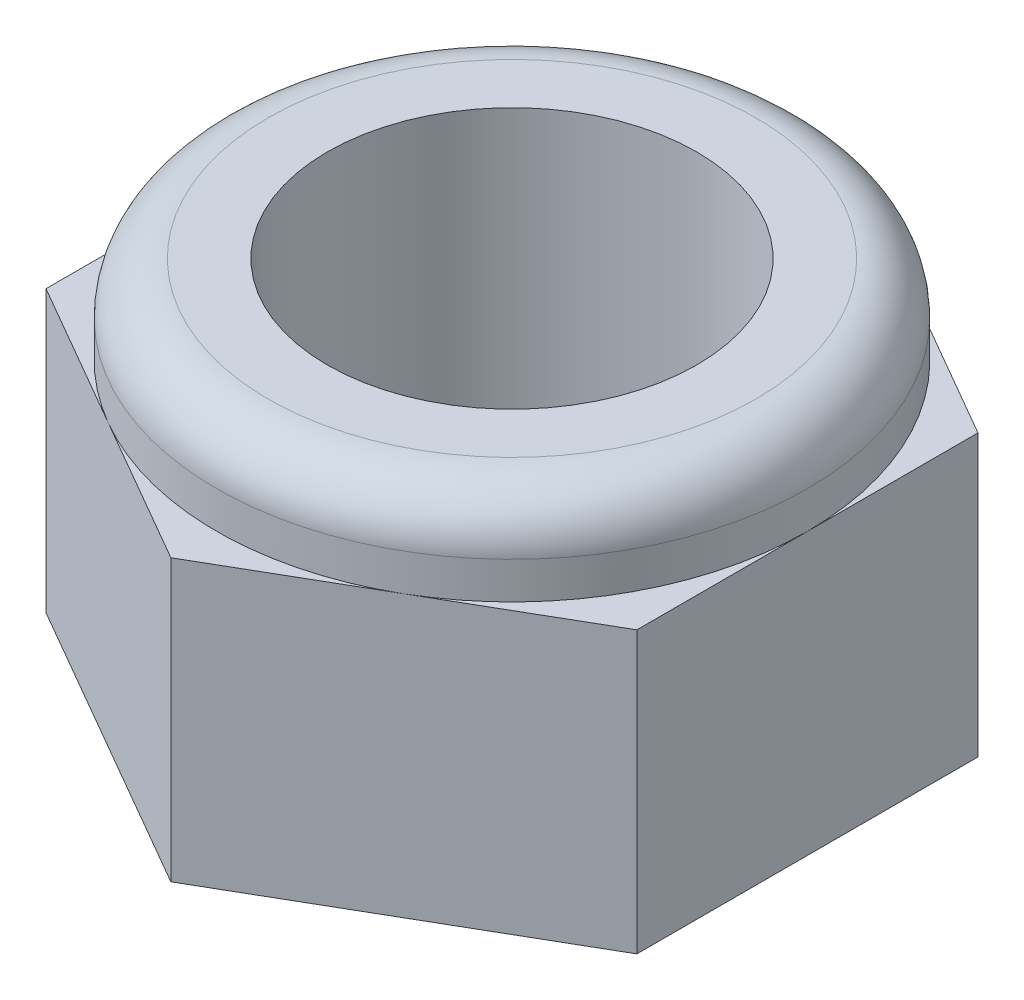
ISO-10303-21;
HEADER;
FILE_DESCRIPTION(('STEP AP214'),'2;1');
FILE_NAME('part.step','',(''),(''),'','','');
FILE_SCHEMA(('AUTOMOTIVE_DESIGN { 1 0 10303 214 1 1 1 1 }'));
ENDSEC;
DATA;
#1=APPLICATION_CONTEXT('core data for automotive mechanical design processes');
#2=APPLICATION_PROTOCOL_DEFINITION('international standard','automotive_design',2000,#1);
#3=PRODUCT_CONTEXT('',#1,'mechanical');
#4=PRODUCT('Part','Part','',(#3));
#5=PRODUCT_RELATED_PRODUCT_CATEGORY('part','',(#4));
#6=PRODUCT_DEFINITION_FORMATION('','',#4);
#7=PRODUCT_DEFINITION_CONTEXT('part definition',#1,'design');
#8=PRODUCT_DEFINITION('design','',#6,#7);
#9=PRODUCT_DEFINITION_SHAPE('','',#8);
#10=(LENGTH_UNIT() NAMED_UNIT(*) SI_UNIT(.MILLI.,.METRE.));
#11=(NAMED_UNIT(*) PLANE_ANGLE_UNIT() SI_UNIT($,.RADIAN.));
#12=(NAMED_UNIT(*) SI_UNIT($,.STERADIAN.) SOLID_ANGLE_UNIT());
#13=UNCERTAINTY_MEASURE_WITH_UNIT(LENGTH_MEASURE(1.E-05),#10,'distance_accuracy_value','');
#14=(GEOMETRIC_REPRESENTATION_CONTEXT(3) GLOBAL_UNCERTAINTY_ASSIGNED_CONTEXT((#13)) GLOBAL_UNIT_ASSIGNED_CONTEXT((#10,
#11,#12)) REPRESENTATION_CONTEXT('',''));
#15=CARTESIAN_POINT('',(0.,0.,0.));
#16=DIRECTION('',(0.,0.,1.));
#17=DIRECTION('',(1.,0.,0.));
#18=AXIS2_PLACEMENT_3D('',#15,#16,#17);
#19=CARTESIAN_POINT('',(4.,3.8,2.30940107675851));
#20=DIRECTION('',(0.,1.,0.));
#21=DIRECTION('',(0.,0.,1.));
#22=AXIS2_PLACEMENT_3D('',#19,#20,#21);
#23=PLANE('',#22);
#24=DIRECTION('',(0.,0.,-1.));
#25=VECTOR('',#24,1.);
#26=CARTESIAN_POINT('',(4.,3.8,2.30940107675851));
#27=LINE('',#26,#25);
#28=CARTESIAN_POINT('',(4.,3.8,2.30940107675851));
#29=VERTEX_POINT('',#28);
#30=CARTESIAN_POINT('',(4.,3.8,0.));
#31=VERTEX_POINT('',#30);
#32=EDGE_CURVE('E223',#29,#31,#27,.T.);
#33=ORIENTED_EDGE('',*,*,#32,.T.);
#34=CARTESIAN_POINT('',(0.,3.8,0.));
#35=DIRECTION('',(0.,-1.,0.));
#36=DIRECTION('',(1.,0.,0.));
#37=AXIS2_PLACEMENT_3D('',#34,#35,#36);
#38=CIRCLE('',#37,4.);
#39=CARTESIAN_POINT('',(2.,3.8,3.46410161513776));
#40=VERTEX_POINT('',#39);
#41=EDGE_CURVE('E46',#31,#40,#38,.T.);
#42=ORIENTED_EDGE('',*,*,#41,.T.);
#43=DIRECTION('',(0.866025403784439,0.,-0.5));
#44=VECTOR('',#43,1.);
#45=CARTESIAN_POINT('',(0.,3.8,4.61880215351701));
#46=LINE('',#45,#44);
#47=EDGE_CURVE('E96',#40,#29,#46,.T.);
#48=ORIENTED_EDGE('',*,*,#47,.T.);
#49=EDGE_LOOP('',(#33,#42,#48));
#50=FACE_BOUND('',#49,.T.);
#51=ADVANCED_FACE('F35',(#50),#23,.T.);
#52=CARTESIAN_POINT('',(0.,3.8,4.61880215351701));
#53=VERTEX_POINT('',#52);
#54=EDGE_CURVE('E201',#53,#40,#46,.T.);
#55=ORIENTED_EDGE('',*,*,#54,.T.);
#56=CARTESIAN_POINT('',(-2.,3.8,3.46410161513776));
#57=VERTEX_POINT('',#56);
#58=EDGE_CURVE('E11',#40,#57,#38,.T.);
#59=ORIENTED_EDGE('',*,*,#58,.T.);
#60=DIRECTION('',(0.866025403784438,0.,0.5));
#61=VECTOR('',#60,1.);
#62=CARTESIAN_POINT('',(-4.,3.8,2.30940107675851));
#63=LINE('',#62,#61);
#64=EDGE_CURVE('E60',#57,#53,#63,.T.);
#65=ORIENTED_EDGE('',*,*,#64,.T.);
#66=EDGE_LOOP('',(#55,#59,#65));
#67=FACE_BOUND('',#66,.T.);
#68=ADVANCED_FACE('F220',(#67),#23,.T.);
#69=CARTESIAN_POINT('',(-4.,3.8,2.30940107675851));
#70=VERTEX_POINT('',#69);
#71=EDGE_CURVE('E141',#70,#57,#63,.T.);
#72=ORIENTED_EDGE('',*,*,#71,.T.);
#73=CARTESIAN_POINT('',(-4.,3.8,0.));
#74=VERTEX_POINT('',#73);
#75=EDGE_CURVE('E44',#57,#74,#38,.T.);
#76=ORIENTED_EDGE('',*,*,#75,.T.);
#77=DIRECTION('',(0.,0.,1.));
#78=VECTOR('',#77,1.);
#79=CARTESIAN_POINT('',(-4.,3.8,-2.30940107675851));
#80=LINE('',#79,#78);
#81=EDGE_CURVE('E139',#74,#70,#80,.T.);
#82=ORIENTED_EDGE('',*,*,#81,.T.);
#83=EDGE_LOOP('',(#72,#76,#82));
#84=FACE_BOUND('',#83,.T.);
#85=ADVANCED_FACE('F208',(#84),#23,.T.);
#86=CARTESIAN_POINT('',(-4.,3.8,-2.30940107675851));
#87=VERTEX_POINT('',#86);
#88=EDGE_CURVE('E115',#87,#74,#80,.T.);
#89=ORIENTED_EDGE('',*,*,#88,.T.);
#90=CARTESIAN_POINT('',(-2.,3.8,-3.46410161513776));
#91=VERTEX_POINT('',#90);
#92=EDGE_CURVE('E118',#74,#91,#38,.T.);
#93=ORIENTED_EDGE('',*,*,#92,.T.);
#94=DIRECTION('',(-0.866025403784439,0.,0.5));
#95=VECTOR('',#94,1.);
#96=CARTESIAN_POINT('',(0.,3.8,-4.61880215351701));
#97=LINE('',#96,#95);
#98=EDGE_CURVE('E110',#91,#87,#97,.T.);
#99=ORIENTED_EDGE('',*,*,#98,.T.);
#100=EDGE_LOOP('',(#89,#93,#99));
#101=FACE_BOUND('',#100,.T.);
#102=ADVANCED_FACE('F112',(#101),#23,.T.);
#103=CARTESIAN_POINT('',(0.,3.8,-4.61880215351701));
#104=VERTEX_POINT('',#103);
#105=EDGE_CURVE('E122',#104,#91,#97,.T.);
#106=ORIENTED_EDGE('',*,*,#105,.T.);
#107=CARTESIAN_POINT('',(2.,3.8,-3.46410161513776));
#108=VERTEX_POINT('',#107);
#109=EDGE_CURVE('E171',#91,#108,#38,.T.);
#110=ORIENTED_EDGE('',*,*,#109,.T.);
#111=DIRECTION('',(-0.866025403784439,0.,-0.5));
#112=VECTOR('',#111,1.);
#113=CARTESIAN_POINT('',(4.,3.8,-2.30940107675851));
#114=LINE('',#113,#112);
#115=EDGE_CURVE('E215',#108,#104,#114,.T.);
#116=ORIENTED_EDGE('',*,*,#115,.T.);
#117=EDGE_LOOP('',(#106,#110,#116));
#118=FACE_BOUND('',#117,.T.);
#119=ADVANCED_FACE('F213',(#118),#23,.T.);
#120=CARTESIAN_POINT('',(4.,3.8,-2.30940107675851));
#121=VERTEX_POINT('',#120);
#122=EDGE_CURVE('E123',#121,#108,#114,.T.);
#123=ORIENTED_EDGE('',*,*,#122,.T.);
#124=EDGE_CURVE('E168',#108,#31,#38,.T.);
#125=ORIENTED_EDGE('',*,*,#124,.T.);
#126=EDGE_CURVE('E221',#31,#121,#27,.T.);
#127=ORIENTED_EDGE('',*,*,#126,.T.);
#128=EDGE_LOOP('',(#123,#125,#127));
#129=FACE_BOUND('',#128,.T.);
#130=ADVANCED_FACE('F226',(#129),#23,.T.);
#131=CARTESIAN_POINT('',(0.,3.8,4.61880215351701));
#132=DIRECTION('',(-0.5,0.,-0.866025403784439));
#133=DIRECTION('',(-0.866025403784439,0.,0.5));
#134=AXIS2_PLACEMENT_3D('',#131,#132,#133);
#135=PLANE('',#134);
#136=DIRECTION('',(0.866025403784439,0.,-0.5));
#137=VECTOR('',#136,1.);
#138=CARTESIAN_POINT('',(0.,0.,4.61880215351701));
#139=LINE('',#138,#137);
#140=CARTESIAN_POINT('',(0.,0.,4.61880215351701));
#141=VERTEX_POINT('',#140);
#142=CARTESIAN_POINT('',(4.,0.,2.30940107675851));
#143=VERTEX_POINT('',#142);
#144=EDGE_CURVE('E147',#141,#143,#139,.T.);
#145=ORIENTED_EDGE('',*,*,#144,.T.);
#146=DIRECTION('',(0.,-1.,0.));
#147=VECTOR('',#146,1.);
#148=CARTESIAN_POINT('',(4.,3.8,2.30940107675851));
#149=LINE('',#148,#147);
#150=EDGE_CURVE('E39',#29,#143,#149,.T.);
#151=ORIENTED_EDGE('',*,*,#150,.F.);
#152=ORIENTED_EDGE('',*,*,#47,.F.);
#153=ORIENTED_EDGE('',*,*,#54,.F.);
#154=DIRECTION('',(0.,-1.,0.));
#155=VECTOR('',#154,1.);
#156=CARTESIAN_POINT('',(0.,3.8,4.61880215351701));
#157=LINE('',#156,#155);
#158=EDGE_CURVE('E146',#53,#141,#157,.T.);
#159=ORIENTED_EDGE('',*,*,#158,.T.);
#160=EDGE_LOOP('',(#145,#151,#152,#153,#159));
#161=FACE_BOUND('',#160,.T.);
#162=ADVANCED_FACE('F37',(#161),#135,.F.);
#163=CARTESIAN_POINT('',(4.,3.8,2.30940107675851));
#164=DIRECTION('',(-1.,0.,0.));
#165=DIRECTION('',(0.,0.,1.));
#166=AXIS2_PLACEMENT_3D('',#163,#164,#165);
#167=PLANE('',#166);
#168=DIRECTION('',(0.,0.,-1.));
#169=VECTOR('',#168,1.);
#170=CARTESIAN_POINT('',(4.,0.,2.30940107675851));
#171=LINE('',#170,#169);
#172=CARTESIAN_POINT('',(4.,0.,-2.30940107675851));
#173=VERTEX_POINT('',#172);
#174=EDGE_CURVE('E150',#143,#173,#171,.T.);
#175=ORIENTED_EDGE('',*,*,#174,.T.);
#176=DIRECTION('',(0.,-1.,0.));
#177=VECTOR('',#176,1.);
#178=CARTESIAN_POINT('',(4.,3.8,-2.30940107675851));
#179=LINE('',#178,#177);
#180=EDGE_CURVE('E161',#121,#173,#179,.T.);
#181=ORIENTED_EDGE('',*,*,#180,.F.);
#182=ORIENTED_EDGE('',*,*,#126,.F.);
#183=ORIENTED_EDGE('',*,*,#32,.F.);
#184=ORIENTED_EDGE('',*,*,#150,.T.);
#185=EDGE_LOOP('',(#175,#181,#182,#183,#184));
#186=FACE_BOUND('',#185,.T.);
#187=ADVANCED_FACE('F227',(#186),#167,.F.);
#188=CARTESIAN_POINT('',(4.,3.8,-2.30940107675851));
#189=DIRECTION('',(-0.5,0.,0.866025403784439));
#190=DIRECTION('',(0.866025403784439,0.,0.5));
#191=AXIS2_PLACEMENT_3D('',#188,#189,#190);
#192=PLANE('',#191);
#193=DIRECTION('',(-0.866025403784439,0.,-0.5));
#194=VECTOR('',#193,1.);
#195=CARTESIAN_POINT('',(4.,0.,-2.30940107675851));
#196=LINE('',#195,#194);
#197=CARTESIAN_POINT('',(0.,0.,-4.61880215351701));
#198=VERTEX_POINT('',#197);
#199=EDGE_CURVE('E153',#173,#198,#196,.T.);
#200=ORIENTED_EDGE('',*,*,#199,.T.);
#201=DIRECTION('',(0.,-1.,0.));
#202=VECTOR('',#201,1.);
#203=CARTESIAN_POINT('',(0.,3.8,-4.61880215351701));
#204=LINE('',#203,#202);
#205=EDGE_CURVE('E133',#104,#198,#204,.T.);
#206=ORIENTED_EDGE('',*,*,#205,.F.);
#207=ORIENTED_EDGE('',*,*,#115,.F.);
#208=ORIENTED_EDGE('',*,*,#122,.F.);
#209=ORIENTED_EDGE('',*,*,#180,.T.);
#210=EDGE_LOOP('',(#200,#206,#207,#208,#209));
#211=FACE_BOUND('',#210,.T.);
#212=ADVANCED_FACE('F210',(#211),#192,.F.);
#213=CARTESIAN_POINT('',(0.,3.8,-4.61880215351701));
#214=DIRECTION('',(0.5,0.,0.866025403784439));
#215=DIRECTION('',(0.866025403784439,0.,-0.5));
#216=AXIS2_PLACEMENT_3D('',#213,#214,#215);
#217=PLANE('',#216);
#218=DIRECTION('',(-0.866025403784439,0.,0.5));
#219=VECTOR('',#218,1.);
#220=CARTESIAN_POINT('',(0.,0.,-4.61880215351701));
#221=LINE('',#220,#219);
#222=CARTESIAN_POINT('',(-4.,0.,-2.30940107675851));
#223=VERTEX_POINT('',#222);
#224=EDGE_CURVE('E130',#198,#223,#221,.T.);
#225=ORIENTED_EDGE('',*,*,#224,.T.);
#226=DIRECTION('',(0.,-1.,0.));
#227=VECTOR('',#226,1.);
#228=CARTESIAN_POINT('',(-4.,3.8,-2.30940107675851));
#229=LINE('',#228,#227);
#230=EDGE_CURVE('E126',#87,#223,#229,.T.);
#231=ORIENTED_EDGE('',*,*,#230,.F.);
#232=ORIENTED_EDGE('',*,*,#98,.F.);
#233=ORIENTED_EDGE('',*,*,#105,.F.);
#234=ORIENTED_EDGE('',*,*,#205,.T.);
#235=EDGE_LOOP('',(#225,#231,#232,#233,#234));
#236=FACE_BOUND('',#235,.T.);
#237=ADVANCED_FACE('F127',(#236),#217,.F.);
#238=CARTESIAN_POINT('',(-4.,3.8,-2.30940107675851));
#239=DIRECTION('',(1.,0.,0.));
#240=DIRECTION('',(0.,0.,-1.));
#241=AXIS2_PLACEMENT_3D('',#238,#239,#240);
#242=PLANE('',#241);
#243=DIRECTION('',(0.,0.,1.));
#244=VECTOR('',#243,1.);
#245=CARTESIAN_POINT('',(-4.,0.,-2.30940107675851));
#246=LINE('',#245,#244);
#247=CARTESIAN_POINT('',(-4.,0.,2.30940107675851));
#248=VERTEX_POINT('',#247);
#249=EDGE_CURVE('E156',#223,#248,#246,.T.);
#250=ORIENTED_EDGE('',*,*,#249,.T.);
#251=DIRECTION('',(0.,-1.,0.));
#252=VECTOR('',#251,1.);
#253=CARTESIAN_POINT('',(-4.,3.8,2.30940107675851));
#254=LINE('',#253,#252);
#255=EDGE_CURVE('E134',#70,#248,#254,.T.);
#256=ORIENTED_EDGE('',*,*,#255,.F.);
#257=ORIENTED_EDGE('',*,*,#81,.F.);
#258=ORIENTED_EDGE('',*,*,#88,.F.);
#259=ORIENTED_EDGE('',*,*,#230,.T.);
#260=EDGE_LOOP('',(#250,#256,#257,#258,#259));
#261=FACE_BOUND('',#260,.T.);
#262=ADVANCED_FACE('F137',(#261),#242,.F.);
#263=CARTESIAN_POINT('',(-4.,3.8,2.30940107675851));
#264=DIRECTION('',(0.5,0.,-0.866025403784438));
#265=DIRECTION('',(-0.866025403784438,0.,-0.5));
#266=AXIS2_PLACEMENT_3D('',#263,#264,#265);
#267=PLANE('',#266);
#268=DIRECTION('',(0.866025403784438,0.,0.5));
#269=VECTOR('',#268,1.);
#270=CARTESIAN_POINT('',(-4.,0.,2.30940107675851));
#271=LINE('',#270,#269);
#272=EDGE_CURVE('E88',#248,#141,#271,.T.);
#273=ORIENTED_EDGE('',*,*,#272,.T.);
#274=ORIENTED_EDGE('',*,*,#158,.F.);
#275=ORIENTED_EDGE('',*,*,#64,.F.);
#276=ORIENTED_EDGE('',*,*,#71,.F.);
#277=ORIENTED_EDGE('',*,*,#255,.T.);
#278=EDGE_LOOP('',(#273,#274,#275,#276,#277));
#279=FACE_BOUND('',#278,.T.);
#280=ADVANCED_FACE('F196',(#279),#267,.F.);
#281=CARTESIAN_POINT('',(4.,0.,2.30940107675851));
#282=DIRECTION('',(0.,1.,0.));
#283=DIRECTION('',(0.,0.,1.));
#284=AXIS2_PLACEMENT_3D('',#281,#282,#283);
#285=PLANE('',#284);
#286=CARTESIAN_POINT('',(0.,0.,0.));
#287=DIRECTION('',(0.,-1.,0.));
#288=DIRECTION('',(0.,0.,-1.));
#289=AXIS2_PLACEMENT_3D('',#286,#287,#288);
#290=CIRCLE('',#289,2.5);
#291=CARTESIAN_POINT('',(0.,0.,-2.5));
#292=VERTEX_POINT('',#291);
#293=EDGE_CURVE('E183',#292,#292,#290,.T.);
#294=ORIENTED_EDGE('',*,*,#293,.F.);
#295=EDGE_LOOP('',(#294));
#296=FACE_BOUND('',#295,.T.);
#297=ORIENTED_EDGE('',*,*,#144,.F.);
#298=ORIENTED_EDGE('',*,*,#272,.F.);
#299=ORIENTED_EDGE('',*,*,#249,.F.);
#300=ORIENTED_EDGE('',*,*,#224,.F.);
#301=ORIENTED_EDGE('',*,*,#199,.F.);
#302=ORIENTED_EDGE('',*,*,#174,.F.);
#303=EDGE_LOOP('',(#297,#298,#299,#300,#301,#302));
#304=FACE_BOUND('',#303,.T.);
#305=ADVANCED_FACE('F192',(#296,#304),#285,.F.);
#306=CARTESIAN_POINT('',(0.,5.,0.));
#307=DIRECTION('',(0.,-1.,0.));
#308=DIRECTION('',(1.,0.,0.));
#309=AXIS2_PLACEMENT_3D('',#306,#307,#308);
#310=PLANE('',#309);
#311=CARTESIAN_POINT('',(0.,5.,0.));
#312=DIRECTION('',(0.,-1.,0.));
#313=DIRECTION('',(0.,0.,-1.));
#314=AXIS2_PLACEMENT_3D('',#311,#312,#313);
#315=CIRCLE('',#314,2.5);
#316=CARTESIAN_POINT('',(0.,5.,-2.5));
#317=VERTEX_POINT('',#316);
#318=EDGE_CURVE('E179',#317,#317,#315,.T.);
#319=ORIENTED_EDGE('',*,*,#318,.T.);
#320=EDGE_LOOP('',(#319));
#321=FACE_BOUND('',#320,.T.);
#322=CARTESIAN_POINT('',(0.,5.,0.));
#323=DIRECTION('',(0.,-1.,0.));
#324=DIRECTION('',(1.,0.,0.));
#325=AXIS2_PLACEMENT_3D('',#322,#323,#324);
#326=CIRCLE('',#325,3.3);
#327=CARTESIAN_POINT('',(3.3,5.,0.));
#328=VERTEX_POINT('',#327);
#329=EDGE_CURVE('E151',#328,#328,#326,.T.);
#330=ORIENTED_EDGE('',*,*,#329,.F.);
#331=EDGE_LOOP('',(#330));
#332=FACE_BOUND('',#331,.T.);
#333=ADVANCED_FACE('F195',(#321,#332),#310,.F.);
#334=CARTESIAN_POINT('',(0.,4.3,0.));
#335=DIRECTION('',(0.,-1.,0.));
#336=DIRECTION('',(1.,0.,0.));
#337=AXIS2_PLACEMENT_3D('',#334,#335,#336);
#338=TOROIDAL_SURFACE('',#337,3.3,0.7);
#339=CARTESIAN_POINT('',(0.,4.3,0.));
#340=DIRECTION('',(0.,-1.,0.));
#341=DIRECTION('',(1.,0.,0.));
#342=AXIS2_PLACEMENT_3D('',#339,#340,#341);
#343=CIRCLE('',#342,4.);
#344=CARTESIAN_POINT('',(4.,4.3,0.));
#345=VERTEX_POINT('',#344);
#346=EDGE_CURVE('E178',#345,#345,#343,.T.);
#347=ORIENTED_EDGE('',*,*,#346,.F.);
#348=EDGE_LOOP('',(#347));
#349=FACE_BOUND('',#348,.T.);
#350=ORIENTED_EDGE('',*,*,#329,.T.);
#351=EDGE_LOOP('',(#350));
#352=FACE_BOUND('',#351,.T.);
#353=ADVANCED_FACE('F270',(#349,#352),#338,.T.);
#354=CARTESIAN_POINT('',(0.,3.8,0.));
#355=DIRECTION('',(0.,-1.,0.));
#356=DIRECTION('',(1.,0.,0.));
#357=AXIS2_PLACEMENT_3D('',#354,#355,#356);
#358=CYLINDRICAL_SURFACE('',#357,4.);
#359=ORIENTED_EDGE('',*,*,#41,.F.);
#360=ORIENTED_EDGE('',*,*,#124,.F.);
#361=ORIENTED_EDGE('',*,*,#109,.F.);
#362=ORIENTED_EDGE('',*,*,#92,.F.);
#363=ORIENTED_EDGE('',*,*,#75,.F.);
#364=ORIENTED_EDGE('',*,*,#58,.F.);
#365=EDGE_LOOP('',(#359,#360,#361,#362,#363,#364));
#366=FACE_BOUND('',#365,.T.);
#367=ORIENTED_EDGE('',*,*,#346,.T.);
#368=EDGE_LOOP('',(#367));
#369=FACE_BOUND('',#368,.T.);
#370=ADVANCED_FACE('F218',(#366,#369),#358,.T.);
#371=CARTESIAN_POINT('',(0.,5.,0.));
#372=DIRECTION('',(0.,-1.,0.));
#373=DIRECTION('',(0.,0.,-1.));
#374=AXIS2_PLACEMENT_3D('',#371,#372,#373);
#375=CYLINDRICAL_SURFACE('',#374,2.5);
#376=ORIENTED_EDGE('',*,*,#318,.F.);
#377=EDGE_LOOP('',(#376));
#378=FACE_BOUND('',#377,.T.);
#379=ORIENTED_EDGE('',*,*,#293,.T.);
#380=EDGE_LOOP('',(#379));
#381=FACE_BOUND('',#380,.T.);
#382=ADVANCED_FACE('F190',(#378,#381),#375,.F.);
#383=CLOSED_SHELL('',(#51,#68,#85,#102,#119,#130,#162,#187,#212,#237,#262,#280,#305,#333,#353,
#370,#382));
#384=MANIFOLD_SOLID_BREP('B2',#383);
#385=ADVANCED_BREP_SHAPE_REPRESENTATION('',(#18,#384),#14);
#386=SHAPE_DEFINITION_REPRESENTATION(#9,#385);
ENDSEC;
END-ISO-10303-21;
